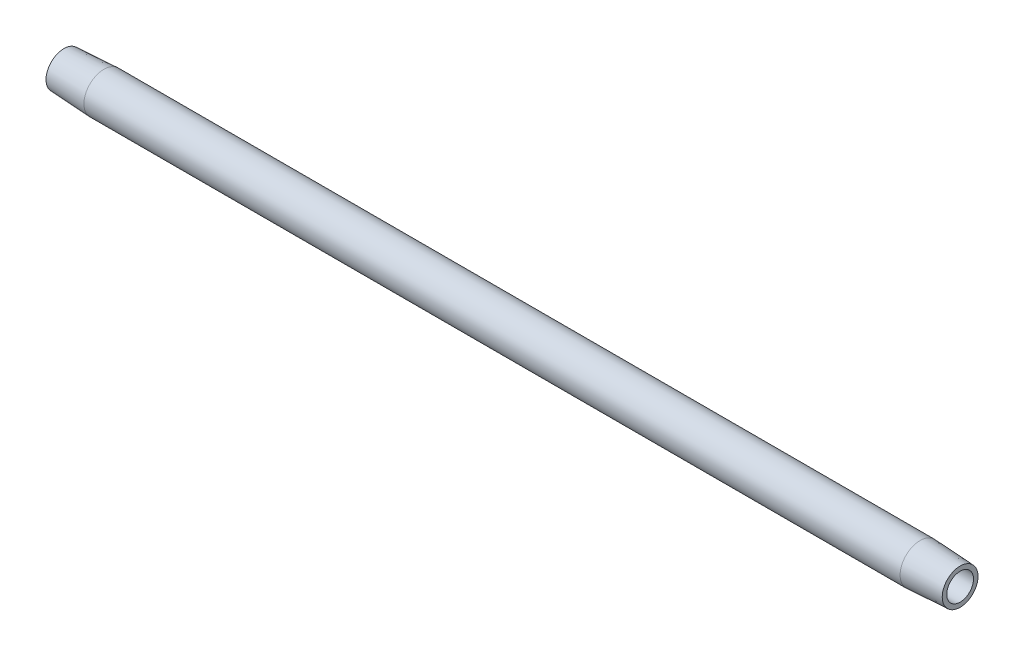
ISO-10303-21;
HEADER;
FILE_DESCRIPTION(('STEP AP214'),'2;1');
FILE_NAME('part.step','',(''),(''),'','','');
FILE_SCHEMA(('AUTOMOTIVE_DESIGN { 1 0 10303 214 1 1 1 1 }'));
ENDSEC;
DATA;
#1=APPLICATION_CONTEXT('core data for automotive mechanical design processes');
#2=APPLICATION_PROTOCOL_DEFINITION('international standard','automotive_design',2000,#1);
#3=PRODUCT_CONTEXT('',#1,'mechanical');
#4=PRODUCT('Part','Part','',(#3));
#5=PRODUCT_RELATED_PRODUCT_CATEGORY('part','',(#4));
#6=PRODUCT_DEFINITION_FORMATION('','',#4);
#7=PRODUCT_DEFINITION_CONTEXT('part definition',#1,'design');
#8=PRODUCT_DEFINITION('design','',#6,#7);
#9=PRODUCT_DEFINITION_SHAPE('','',#8);
#10=(LENGTH_UNIT() NAMED_UNIT(*) SI_UNIT(.MILLI.,.METRE.));
#11=(NAMED_UNIT(*) PLANE_ANGLE_UNIT() SI_UNIT($,.RADIAN.));
#12=(NAMED_UNIT(*) SI_UNIT($,.STERADIAN.) SOLID_ANGLE_UNIT());
#13=UNCERTAINTY_MEASURE_WITH_UNIT(LENGTH_MEASURE(1.E-05),#10,'distance_accuracy_value','');
#14=(GEOMETRIC_REPRESENTATION_CONTEXT(3) GLOBAL_UNCERTAINTY_ASSIGNED_CONTEXT((#13)) GLOBAL_UNIT_ASSIGNED_CONTEXT((#10,
#11,#12)) REPRESENTATION_CONTEXT('',''));
#15=CARTESIAN_POINT('',(0.,0.,0.));
#16=DIRECTION('',(0.,0.,1.));
#17=DIRECTION('',(1.,0.,0.));
#18=AXIS2_PLACEMENT_3D('',#15,#16,#17);
#19=CARTESIAN_POINT('',(0.476141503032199,0.,0.));
#20=DIRECTION('',(-1.,0.,0.));
#21=DIRECTION('',(0.,0.,1.));
#22=AXIS2_PLACEMENT_3D('',#19,#20,#21);
#23=CYLINDRICAL_SURFACE('',#22,3.96875);
#24=CARTESIAN_POINT('',(7.9375,0.,0.));
#25=DIRECTION('',(-1.,0.,0.));
#26=DIRECTION('',(0.,0.,1.));
#27=AXIS2_PLACEMENT_3D('',#24,#25,#26);
#28=CIRCLE('',#27,3.96875);
#29=CARTESIAN_POINT('',(7.9375,0.,3.96875));
#30=VERTEX_POINT('',#29);
#31=EDGE_CURVE('E10',#30,#30,#28,.T.);
#32=ORIENTED_EDGE('',*,*,#31,.F.);
#33=EDGE_LOOP('',(#32));
#34=FACE_BOUND('',#33,.T.);
#35=CARTESIAN_POINT('',(169.8625,0.,0.));
#36=DIRECTION('',(-1.,0.,0.));
#37=DIRECTION('',(0.,0.,1.));
#38=AXIS2_PLACEMENT_3D('',#35,#36,#37);
#39=CIRCLE('',#38,3.96875);
#40=CARTESIAN_POINT('',(169.8625,0.,3.96875));
#41=VERTEX_POINT('',#40);
#42=EDGE_CURVE('E52',#41,#41,#39,.T.);
#43=ORIENTED_EDGE('',*,*,#42,.T.);
#44=EDGE_LOOP('',(#43));
#45=FACE_BOUND('',#44,.T.);
#46=ADVANCED_FACE('F30',(#34,#45),#23,.T.);
#47=CARTESIAN_POINT('',(7.9375,0.,0.));
#48=DIRECTION('',(1.,0.,0.));
#49=DIRECTION('',(0.,0.,-1.));
#50=AXIS2_PLACEMENT_3D('',#47,#48,#49);
#51=CONICAL_SURFACE('',#50,3.96875,0.0523598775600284);
#52=CARTESIAN_POINT('',(0.,0.,0.));
#53=DIRECTION('',(-1.,0.,0.));
#54=DIRECTION('',(0.,0.,1.));
#55=AXIS2_PLACEMENT_3D('',#52,#53,#54);
#56=CIRCLE('',#55,3.55276325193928);
#57=CARTESIAN_POINT('',(0.,0.,3.55276325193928));
#58=VERTEX_POINT('',#57);
#59=EDGE_CURVE('E36',#58,#58,#56,.T.);
#60=ORIENTED_EDGE('',*,*,#59,.F.);
#61=EDGE_LOOP('',(#60));
#62=FACE_BOUND('',#61,.T.);
#63=ORIENTED_EDGE('',*,*,#31,.T.);
#64=EDGE_LOOP('',(#63));
#65=FACE_BOUND('',#64,.T.);
#66=ADVANCED_FACE('F77',(#62,#65),#51,.T.);
#67=CARTESIAN_POINT('',(0.,3.55276325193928,0.));
#68=DIRECTION('',(1.,0.,0.));
#69=DIRECTION('',(0.,0.,-1.));
#70=AXIS2_PLACEMENT_3D('',#67,#68,#69);
#71=PLANE('',#70);
#72=CARTESIAN_POINT('',(0.,0.,0.));
#73=DIRECTION('',(-1.,0.,0.));
#74=DIRECTION('',(0.,0.,1.));
#75=AXIS2_PLACEMENT_3D('',#72,#73,#74);
#76=CIRCLE('',#75,2.65429999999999);
#77=CARTESIAN_POINT('',(0.,0.,2.65429999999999));
#78=VERTEX_POINT('',#77);
#79=EDGE_CURVE('E40',#78,#78,#76,.T.);
#80=ORIENTED_EDGE('',*,*,#79,.F.);
#81=EDGE_LOOP('',(#80));
#82=FACE_BOUND('',#81,.T.);
#83=ORIENTED_EDGE('',*,*,#59,.T.);
#84=EDGE_LOOP('',(#83));
#85=FACE_BOUND('',#84,.T.);
#86=ADVANCED_FACE('F72',(#82,#85),#71,.F.);
#87=CARTESIAN_POINT('',(0.476141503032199,0.,0.));
#88=DIRECTION('',(-1.,0.,0.));
#89=DIRECTION('',(0.,0.,1.));
#90=AXIS2_PLACEMENT_3D('',#87,#88,#89);
#91=CYLINDRICAL_SURFACE('',#90,2.6543);
#92=CARTESIAN_POINT('',(177.8,0.,0.));
#93=DIRECTION('',(-1.,0.,0.));
#94=DIRECTION('',(0.,0.,1.));
#95=AXIS2_PLACEMENT_3D('',#92,#93,#94);
#96=CIRCLE('',#95,2.6543);
#97=CARTESIAN_POINT('',(177.8,0.,2.6543));
#98=VERTEX_POINT('',#97);
#99=EDGE_CURVE('E44',#98,#98,#96,.T.);
#100=ORIENTED_EDGE('',*,*,#99,.F.);
#101=EDGE_LOOP('',(#100));
#102=FACE_BOUND('',#101,.T.);
#103=ORIENTED_EDGE('',*,*,#79,.T.);
#104=EDGE_LOOP('',(#103));
#105=FACE_BOUND('',#104,.T.);
#106=ADVANCED_FACE('F66',(#102,#105),#91,.F.);
#107=CARTESIAN_POINT('',(177.8,2.6543,0.));
#108=DIRECTION('',(-1.,0.,0.));
#109=DIRECTION('',(0.,0.,1.));
#110=AXIS2_PLACEMENT_3D('',#107,#108,#109);
#111=PLANE('',#110);
#112=CARTESIAN_POINT('',(177.8,0.,0.));
#113=DIRECTION('',(-1.,0.,0.));
#114=DIRECTION('',(0.,0.,1.));
#115=AXIS2_PLACEMENT_3D('',#112,#113,#114);
#116=CIRCLE('',#115,3.55276325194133);
#117=CARTESIAN_POINT('',(177.8,0.,3.55276325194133));
#118=VERTEX_POINT('',#117);
#119=EDGE_CURVE('E49',#118,#118,#116,.T.);
#120=ORIENTED_EDGE('',*,*,#119,.F.);
#121=EDGE_LOOP('',(#120));
#122=FACE_BOUND('',#121,.T.);
#123=ORIENTED_EDGE('',*,*,#99,.T.);
#124=EDGE_LOOP('',(#123));
#125=FACE_BOUND('',#124,.T.);
#126=ADVANCED_FACE('F60',(#122,#125),#111,.F.);
#127=CARTESIAN_POINT('',(177.8,0.,0.));
#128=DIRECTION('',(-1.,0.,0.));
#129=DIRECTION('',(0.,0.,1.));
#130=AXIS2_PLACEMENT_3D('',#127,#128,#129);
#131=CONICAL_SURFACE('',#130,3.55276325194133,0.0523598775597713);
#132=ORIENTED_EDGE('',*,*,#42,.F.);
#133=EDGE_LOOP('',(#132));
#134=FACE_BOUND('',#133,.T.);
#135=ORIENTED_EDGE('',*,*,#119,.T.);
#136=EDGE_LOOP('',(#135));
#137=FACE_BOUND('',#136,.T.);
#138=ADVANCED_FACE('F57',(#134,#137),#131,.T.);
#139=CLOSED_SHELL('',(#46,#66,#86,#106,#126,#138));
#140=MANIFOLD_SOLID_BREP('B2',#139);
#141=ADVANCED_BREP_SHAPE_REPRESENTATION('',(#18,#140),#14);
#142=SHAPE_DEFINITION_REPRESENTATION(#9,#141);
ENDSEC;
END-ISO-10303-21;
